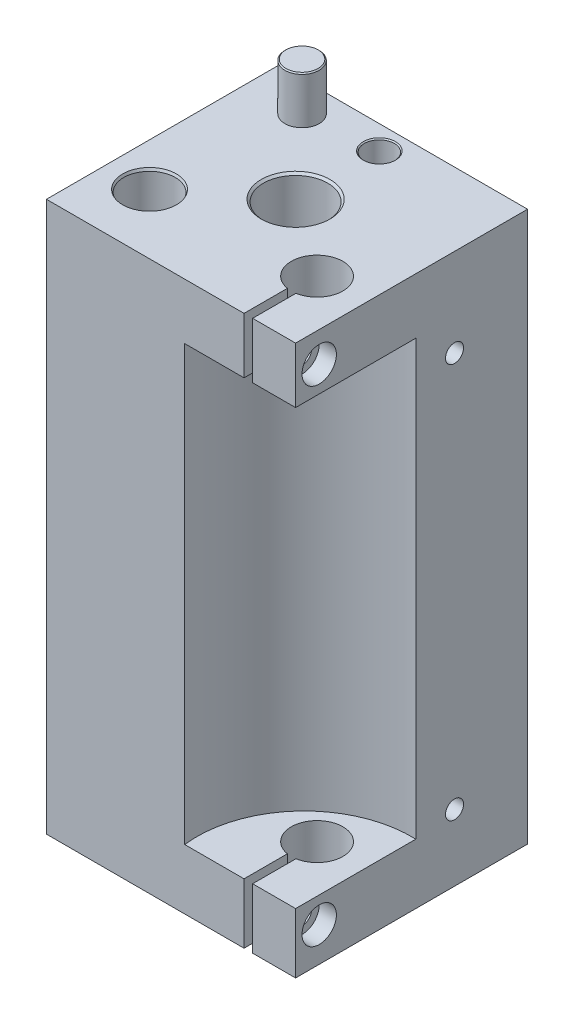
ISO-10303-21;
HEADER;
FILE_DESCRIPTION(('STEP AP214'),'2;1');
FILE_NAME('part.step','',(''),(''),'','','');
FILE_SCHEMA(('AUTOMOTIVE_DESIGN { 1 0 10303 214 1 1 1 1 }'));
ENDSEC;
DATA;
#1=APPLICATION_CONTEXT('core data for automotive mechanical design processes');
#2=APPLICATION_PROTOCOL_DEFINITION('international standard','automotive_design',2000,#1);
#3=PRODUCT_CONTEXT('',#1,'mechanical');
#4=PRODUCT('Part','Part','',(#3));
#5=PRODUCT_RELATED_PRODUCT_CATEGORY('part','',(#4));
#6=PRODUCT_DEFINITION_FORMATION('','',#4);
#7=PRODUCT_DEFINITION_CONTEXT('part definition',#1,'design');
#8=PRODUCT_DEFINITION('design','',#6,#7);
#9=PRODUCT_DEFINITION_SHAPE('','',#8);
#10=(LENGTH_UNIT() NAMED_UNIT(*) SI_UNIT(.MILLI.,.METRE.));
#11=(NAMED_UNIT(*) PLANE_ANGLE_UNIT() SI_UNIT($,.RADIAN.));
#12=(NAMED_UNIT(*) SI_UNIT($,.STERADIAN.) SOLID_ANGLE_UNIT());
#13=UNCERTAINTY_MEASURE_WITH_UNIT(LENGTH_MEASURE(1.E-05),#10,'distance_accuracy_value','');
#14=(GEOMETRIC_REPRESENTATION_CONTEXT(3) GLOBAL_UNCERTAINTY_ASSIGNED_CONTEXT((#13)) GLOBAL_UNIT_ASSIGNED_CONTEXT((#10,
#11,#12)) REPRESENTATION_CONTEXT('',''));
#15=CARTESIAN_POINT('',(0.,0.,0.));
#16=DIRECTION('',(0.,0.,1.));
#17=DIRECTION('',(1.,0.,0.));
#18=AXIS2_PLACEMENT_3D('',#15,#16,#17);
#19=CARTESIAN_POINT('',(58.,128.,0.));
#20=DIRECTION('',(-1.,0.,0.));
#21=DIRECTION('',(0.,0.,1.));
#22=AXIS2_PLACEMENT_3D('',#19,#20,#21);
#23=PLANE('',#22);
#24=CARTESIAN_POINT('',(58.,121.,-5.5));
#25=DIRECTION('',(1.,0.,0.));
#26=DIRECTION('',(0.,0.,-1.));
#27=AXIS2_PLACEMENT_3D('',#24,#25,#26);
#28=CIRCLE('',#27,4.);
#29=CARTESIAN_POINT('',(58.,121.,-9.5));
#30=VERTEX_POINT('',#29);
#31=EDGE_CURVE('E9355',#30,#30,#28,.T.);
#32=ORIENTED_EDGE('',*,*,#31,.F.);
#33=EDGE_LOOP('',(#32));
#34=FACE_BOUND('',#33,.T.);
#35=CARTESIAN_POINT('',(58.,15.5,-37.));
#36=DIRECTION('',(1.,0.,0.));
#37=DIRECTION('',(0.,0.,-1.));
#38=AXIS2_PLACEMENT_3D('',#35,#36,#37);
#39=CIRCLE('',#38,2.09999999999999);
#40=CARTESIAN_POINT('',(58.,15.5,-39.1));
#41=VERTEX_POINT('',#40);
#42=EDGE_CURVE('E9364',#41,#41,#39,.T.);
#43=ORIENTED_EDGE('',*,*,#42,.F.);
#44=EDGE_LOOP('',(#43));
#45=FACE_BOUND('',#44,.T.);
#46=CARTESIAN_POINT('',(58.,107.5,-37.));
#47=DIRECTION('',(1.,0.,0.));
#48=DIRECTION('',(0.,0.,-1.));
#49=AXIS2_PLACEMENT_3D('',#46,#47,#48);
#50=CIRCLE('',#49,2.1);
#51=CARTESIAN_POINT('',(58.,107.5,-39.1));
#52=VERTEX_POINT('',#51);
#53=EDGE_CURVE('E9370',#52,#52,#50,.T.);
#54=ORIENTED_EDGE('',*,*,#53,.F.);
#55=EDGE_LOOP('',(#54));
#56=FACE_BOUND('',#55,.T.);
#57=DIRECTION('',(0.,0.,1.));
#58=VECTOR('',#57,1.);
#59=CARTESIAN_POINT('',(58.,115.,0.));
#60=LINE('',#59,#58);
#61=CARTESIAN_POINT('',(58.,115.,-27.9799919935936));
#62=VERTEX_POINT('',#61);
#63=CARTESIAN_POINT('',(58.,115.,0.));
#64=VERTEX_POINT('',#63);
#65=EDGE_CURVE('E9452',#62,#64,#60,.T.);
#66=ORIENTED_EDGE('',*,*,#65,.F.);
#67=DIRECTION('',(0.,-1.,0.));
#68=VECTOR('',#67,1.);
#69=CARTESIAN_POINT('',(58.,115.,-27.9799919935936));
#70=LINE('',#69,#68);
#71=CARTESIAN_POINT('',(58.,14.,-27.9799919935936));
#72=VERTEX_POINT('',#71);
#73=EDGE_CURVE('E11',#62,#72,#70,.T.);
#74=ORIENTED_EDGE('',*,*,#73,.T.);
#75=DIRECTION('',(0.,0.,1.));
#76=VECTOR('',#75,1.);
#77=CARTESIAN_POINT('',(58.,14.,0.));
#78=LINE('',#77,#76);
#79=CARTESIAN_POINT('',(58.,14.,0.));
#80=VERTEX_POINT('',#79);
#81=EDGE_CURVE('E9440',#72,#80,#78,.T.);
#82=ORIENTED_EDGE('',*,*,#81,.T.);
#83=DIRECTION('',(0.,-1.,0.));
#84=VECTOR('',#83,1.);
#85=CARTESIAN_POINT('',(58.,128.,0.));
#86=LINE('',#85,#84);
#87=CARTESIAN_POINT('',(58.,0.,0.));
#88=VERTEX_POINT('',#87);
#89=EDGE_CURVE('E9547',#80,#88,#86,.T.);
#90=ORIENTED_EDGE('',*,*,#89,.T.);
#91=DIRECTION('',(0.,0.,-1.));
#92=VECTOR('',#91,1.);
#93=CARTESIAN_POINT('',(58.,0.,0.));
#94=LINE('',#93,#92);
#95=CARTESIAN_POINT('',(58.,0.,-54.));
#96=VERTEX_POINT('',#95);
#97=EDGE_CURVE('E9526',#88,#96,#94,.T.);
#98=ORIENTED_EDGE('',*,*,#97,.T.);
#99=DIRECTION('',(0.,-1.,0.));
#100=VECTOR('',#99,1.);
#101=CARTESIAN_POINT('',(58.,128.,-54.));
#102=LINE('',#101,#100);
#103=CARTESIAN_POINT('',(58.,128.,-54.));
#104=VERTEX_POINT('',#103);
#105=EDGE_CURVE('E9544',#104,#96,#102,.T.);
#106=ORIENTED_EDGE('',*,*,#105,.F.);
#107=DIRECTION('',(0.,0.,-1.));
#108=VECTOR('',#107,1.);
#109=CARTESIAN_POINT('',(58.,128.,0.));
#110=LINE('',#109,#108);
#111=CARTESIAN_POINT('',(58.,128.,0.));
#112=VERTEX_POINT('',#111);
#113=EDGE_CURVE('E9537',#112,#104,#110,.T.);
#114=ORIENTED_EDGE('',*,*,#113,.F.);
#115=EDGE_CURVE('E9548',#112,#64,#86,.T.);
#116=ORIENTED_EDGE('',*,*,#115,.T.);
#117=EDGE_LOOP('',(#66,#74,#82,#90,#98,#106,#114,#116));
#118=FACE_BOUND('',#117,.T.);
#119=CARTESIAN_POINT('',(58.,8.,-5.5));
#120=DIRECTION('',(1.,0.,0.));
#121=DIRECTION('',(0.,0.,-1.));
#122=AXIS2_PLACEMENT_3D('',#119,#120,#121);
#123=CIRCLE('',#122,3.99999999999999);
#124=CARTESIAN_POINT('',(58.,8.,-9.49999999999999));
#125=VERTEX_POINT('',#124);
#126=EDGE_CURVE('E9343',#125,#125,#123,.T.);
#127=ORIENTED_EDGE('',*,*,#126,.F.);
#128=EDGE_LOOP('',(#127));
#129=FACE_BOUND('',#128,.T.);
#130=ADVANCED_FACE('F9174',(#34,#45,#56,#118,#129),#23,.F.);
#131=CARTESIAN_POINT('',(0.,128.,0.));
#132=DIRECTION('',(0.,0.,-1.));
#133=DIRECTION('',(-1.,0.,0.));
#134=AXIS2_PLACEMENT_3D('',#131,#132,#133);
#135=PLANE('',#134);
#136=DIRECTION('',(-1.,0.,0.));
#137=VECTOR('',#136,1.);
#138=CARTESIAN_POINT('',(0.,115.,0.));
#139=LINE('',#138,#137);
#140=CARTESIAN_POINT('',(48.,115.,0.));
#141=VERTEX_POINT('',#140);
#142=EDGE_CURVE('E9448',#64,#141,#139,.T.);
#143=ORIENTED_EDGE('',*,*,#142,.F.);
#144=ORIENTED_EDGE('',*,*,#115,.F.);
#145=DIRECTION('',(1.,0.,0.));
#146=VECTOR('',#145,1.);
#147=CARTESIAN_POINT('',(0.,128.,0.));
#148=LINE('',#147,#146);
#149=CARTESIAN_POINT('',(48.,128.,0.));
#150=VERTEX_POINT('',#149);
#151=EDGE_CURVE('E9533',#150,#112,#148,.T.);
#152=ORIENTED_EDGE('',*,*,#151,.F.);
#153=DIRECTION('',(0.,1.,0.));
#154=VECTOR('',#153,1.);
#155=CARTESIAN_POINT('',(48.,130.,0.));
#156=LINE('',#155,#154);
#157=EDGE_CURVE('E9459',#141,#150,#156,.T.);
#158=ORIENTED_EDGE('',*,*,#157,.F.);
#159=EDGE_LOOP('',(#143,#144,#152,#158));
#160=FACE_BOUND('',#159,.T.);
#161=ADVANCED_FACE('F9602',(#160),#135,.F.);
#162=DIRECTION('',(-1.,0.,0.));
#163=VECTOR('',#162,1.);
#164=CARTESIAN_POINT('',(0.,115.,0.));
#165=LINE('',#164,#163);
#166=CARTESIAN_POINT('',(46.,115.,0.));
#167=VERTEX_POINT('',#166);
#168=CARTESIAN_POINT('',(32.1806527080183,115.,0.));
#169=VERTEX_POINT('',#168);
#170=EDGE_CURVE('E9454',#167,#169,#165,.T.);
#171=ORIENTED_EDGE('',*,*,#170,.F.);
#172=DIRECTION('',(0.,-1.,0.));
#173=VECTOR('',#172,1.);
#174=CARTESIAN_POINT('',(46.,130.,0.));
#175=LINE('',#174,#173);
#176=CARTESIAN_POINT('',(46.,128.,0.));
#177=VERTEX_POINT('',#176);
#178=EDGE_CURVE('E9464',#177,#167,#175,.T.);
#179=ORIENTED_EDGE('',*,*,#178,.F.);
#180=CARTESIAN_POINT('',(0.,128.,0.));
#181=VERTEX_POINT('',#180);
#182=EDGE_CURVE('E9534',#181,#177,#148,.T.);
#183=ORIENTED_EDGE('',*,*,#182,.F.);
#184=DIRECTION('',(0.,-1.,0.));
#185=VECTOR('',#184,1.);
#186=CARTESIAN_POINT('',(0.,128.,0.));
#187=LINE('',#186,#185);
#188=CARTESIAN_POINT('',(0.,0.,0.));
#189=VERTEX_POINT('',#188);
#190=EDGE_CURVE('E9551',#181,#189,#187,.T.);
#191=ORIENTED_EDGE('',*,*,#190,.T.);
#192=DIRECTION('',(1.,0.,0.));
#193=VECTOR('',#192,1.);
#194=CARTESIAN_POINT('',(0.,0.,0.));
#195=LINE('',#194,#193);
#196=CARTESIAN_POINT('',(46.,0.,0.));
#197=VERTEX_POINT('',#196);
#198=EDGE_CURVE('E9523',#189,#197,#195,.T.);
#199=ORIENTED_EDGE('',*,*,#198,.T.);
#200=CARTESIAN_POINT('',(46.,14.,0.));
#201=VERTEX_POINT('',#200);
#202=EDGE_CURVE('E9463',#201,#197,#175,.T.);
#203=ORIENTED_EDGE('',*,*,#202,.F.);
#204=DIRECTION('',(-1.,0.,0.));
#205=VECTOR('',#204,1.);
#206=CARTESIAN_POINT('',(0.,14.,0.));
#207=LINE('',#206,#205);
#208=CARTESIAN_POINT('',(32.1806527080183,14.,0.));
#209=VERTEX_POINT('',#208);
#210=EDGE_CURVE('E9443',#201,#209,#207,.T.);
#211=ORIENTED_EDGE('',*,*,#210,.T.);
#212=DIRECTION('',(0.,-1.,0.));
#213=VECTOR('',#212,1.);
#214=CARTESIAN_POINT('',(32.1806527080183,115.,0.));
#215=LINE('',#214,#213);
#216=EDGE_CURVE('E9456',#209,#169,#215,.F.);
#217=ORIENTED_EDGE('',*,*,#216,.T.);
#218=EDGE_LOOP('',(#171,#179,#183,#191,#199,#203,#211,#217));
#219=FACE_BOUND('',#218,.T.);
#220=ADVANCED_FACE('F9590',(#219),#135,.F.);
#221=CARTESIAN_POINT('',(47.,128.,-16.));
#222=DIRECTION('',(0.,1.,0.));
#223=DIRECTION('',(0.,0.,1.));
#224=AXIS2_PLACEMENT_3D('',#221,#222,#223);
#225=CYLINDRICAL_SURFACE('',#224,5.99999999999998);
#226=CARTESIAN_POINT('',(47.,115.,-16.));
#227=DIRECTION('',(0.,-1.,0.));
#228=DIRECTION('',(0.,0.,-1.));
#229=AXIS2_PLACEMENT_3D('',#226,#227,#228);
#230=CIRCLE('',#229,5.99999999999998);
#231=CARTESIAN_POINT('',(48.,115.,-10.0839202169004));
#232=VERTEX_POINT('',#231);
#233=CARTESIAN_POINT('',(46.,115.,-10.0839202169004));
#234=VERTEX_POINT('',#233);
#235=EDGE_CURVE('E9446',#232,#234,#230,.F.);
#236=ORIENTED_EDGE('',*,*,#235,.F.);
#237=DIRECTION('',(0.,1.,0.));
#238=VECTOR('',#237,1.);
#239=CARTESIAN_POINT('',(48.,128.,-10.0839202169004));
#240=LINE('',#239,#238);
#241=CARTESIAN_POINT('',(48.,128.,-10.0839202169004));
#242=VERTEX_POINT('',#241);
#243=EDGE_CURVE('E9197',#232,#242,#240,.T.);
#244=ORIENTED_EDGE('',*,*,#243,.T.);
#245=CARTESIAN_POINT('',(47.,128.,-16.));
#246=DIRECTION('',(0.,1.,0.));
#247=DIRECTION('',(0.,0.,1.));
#248=AXIS2_PLACEMENT_3D('',#245,#246,#247);
#249=CIRCLE('',#248,5.99999999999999);
#250=CARTESIAN_POINT('',(46.,128.,-10.0839202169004));
#251=VERTEX_POINT('',#250);
#252=EDGE_CURVE('E9481',#242,#251,#249,.T.);
#253=ORIENTED_EDGE('',*,*,#252,.T.);
#254=DIRECTION('',(0.,1.,0.));
#255=VECTOR('',#254,1.);
#256=CARTESIAN_POINT('',(46.,128.,-10.0839202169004));
#257=LINE('',#256,#255);
#258=EDGE_CURVE('E9564',#251,#234,#257,.F.);
#259=ORIENTED_EDGE('',*,*,#258,.T.);
#260=EDGE_LOOP('',(#236,#244,#253,#259));
#261=FACE_BOUND('',#260,.T.);
#262=ADVANCED_FACE('F9578',(#261),#225,.F.);
#263=CARTESIAN_POINT('',(46.,130.,-16.));
#264=DIRECTION('',(-1.,0.,0.));
#265=DIRECTION('',(0.,-1.,0.));
#266=AXIS2_PLACEMENT_3D('',#263,#264,#265);
#267=PLANE('',#266);
#268=CARTESIAN_POINT('',(46.,121.,-5.5));
#269=DIRECTION('',(1.,0.,0.));
#270=DIRECTION('',(0.,0.,-1.));
#271=AXIS2_PLACEMENT_3D('',#268,#269,#270);
#272=CIRCLE('',#271,1.64999999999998);
#273=CARTESIAN_POINT('',(46.,121.,-7.14999999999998));
#274=VERTEX_POINT('',#273);
#275=EDGE_CURVE('E9329',#274,#274,#272,.T.);
#276=ORIENTED_EDGE('',*,*,#275,.F.);
#277=EDGE_LOOP('',(#276));
#278=FACE_BOUND('',#277,.T.);
#279=DIRECTION('',(0.,0.,1.));
#280=VECTOR('',#279,1.);
#281=CARTESIAN_POINT('',(46.,115.,-16.));
#282=LINE('',#281,#280);
#283=EDGE_CURVE('E9450',#234,#167,#282,.T.);
#284=ORIENTED_EDGE('',*,*,#283,.F.);
#285=ORIENTED_EDGE('',*,*,#258,.F.);
#286=DIRECTION('',(0.,0.,-1.));
#287=VECTOR('',#286,1.);
#288=CARTESIAN_POINT('',(46.,128.,-54.));
#289=LINE('',#288,#287);
#290=EDGE_CURVE('E9467',#177,#251,#289,.T.);
#291=ORIENTED_EDGE('',*,*,#290,.F.);
#292=ORIENTED_EDGE('',*,*,#178,.T.);
#293=EDGE_LOOP('',(#284,#285,#291,#292));
#294=FACE_BOUND('',#293,.T.);
#295=ADVANCED_FACE('F9587',(#278,#294),#267,.F.);
#296=CARTESIAN_POINT('',(48.,130.,-16.));
#297=DIRECTION('',(1.,0.,0.));
#298=DIRECTION('',(0.,1.,0.));
#299=AXIS2_PLACEMENT_3D('',#296,#297,#298);
#300=PLANE('',#299);
#301=CARTESIAN_POINT('',(48.,121.,-5.5));
#302=DIRECTION('',(1.,0.,0.));
#303=DIRECTION('',(0.,1.,0.));
#304=AXIS2_PLACEMENT_3D('',#301,#302,#303);
#305=CIRCLE('',#304,2.25);
#306=CARTESIAN_POINT('',(48.,123.25,-5.5));
#307=VERTEX_POINT('',#306);
#308=EDGE_CURVE('E9358',#307,#307,#305,.T.);
#309=ORIENTED_EDGE('',*,*,#308,.T.);
#310=EDGE_LOOP('',(#309));
#311=FACE_BOUND('',#310,.T.);
#312=DIRECTION('',(0.,0.,-1.));
#313=VECTOR('',#312,1.);
#314=CARTESIAN_POINT('',(48.,115.,-16.));
#315=LINE('',#314,#313);
#316=EDGE_CURVE('E9182',#141,#232,#315,.T.);
#317=ORIENTED_EDGE('',*,*,#316,.F.);
#318=ORIENTED_EDGE('',*,*,#157,.T.);
#319=DIRECTION('',(0.,0.,1.));
#320=VECTOR('',#319,1.);
#321=CARTESIAN_POINT('',(48.,128.,-54.));
#322=LINE('',#321,#320);
#323=EDGE_CURVE('E9473',#242,#150,#322,.T.);
#324=ORIENTED_EDGE('',*,*,#323,.F.);
#325=ORIENTED_EDGE('',*,*,#243,.F.);
#326=EDGE_LOOP('',(#317,#318,#324,#325));
#327=FACE_BOUND('',#326,.T.);
#328=ADVANCED_FACE('F9579',(#311,#327),#300,.F.);
#329=ORIENTED_EDGE('',*,*,#89,.F.);
#330=DIRECTION('',(-1.,0.,0.));
#331=VECTOR('',#330,1.);
#332=CARTESIAN_POINT('',(0.,14.,0.));
#333=LINE('',#332,#331);
#334=CARTESIAN_POINT('',(48.,14.,0.));
#335=VERTEX_POINT('',#334);
#336=EDGE_CURVE('E9434',#80,#335,#333,.T.);
#337=ORIENTED_EDGE('',*,*,#336,.T.);
#338=CARTESIAN_POINT('',(48.,0.,0.));
#339=VERTEX_POINT('',#338);
#340=EDGE_CURVE('E9460',#339,#335,#156,.T.);
#341=ORIENTED_EDGE('',*,*,#340,.F.);
#342=EDGE_CURVE('E9522',#339,#88,#195,.T.);
#343=ORIENTED_EDGE('',*,*,#342,.T.);
#344=EDGE_LOOP('',(#329,#337,#341,#343));
#345=FACE_BOUND('',#344,.T.);
#346=ADVANCED_FACE('F9633',(#345),#135,.F.);
#347=CARTESIAN_POINT('',(0.,0.,-54.));
#348=DIRECTION('',(0.,-1.,0.));
#349=DIRECTION('',(0.,0.,-1.));
#350=AXIS2_PLACEMENT_3D('',#347,#348,#349);
#351=PLANE('',#350);
#352=DIRECTION('',(0.,0.,1.));
#353=VECTOR('',#352,1.);
#354=CARTESIAN_POINT('',(48.,0.,-54.));
#355=LINE('',#354,#353);
#356=CARTESIAN_POINT('',(48.,0.,-10.0839202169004));
#357=VERTEX_POINT('',#356);
#358=EDGE_CURVE('E9476',#357,#339,#355,.T.);
#359=ORIENTED_EDGE('',*,*,#358,.F.);
#360=CARTESIAN_POINT('',(47.,0.,-16.));
#361=DIRECTION('',(0.,1.,0.));
#362=DIRECTION('',(0.,0.,1.));
#363=AXIS2_PLACEMENT_3D('',#360,#361,#362);
#364=CIRCLE('',#363,5.99999999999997);
#365=CARTESIAN_POINT('',(46.,0.,-10.0839202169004));
#366=VERTEX_POINT('',#365);
#367=EDGE_CURVE('E9478',#357,#366,#364,.T.);
#368=ORIENTED_EDGE('',*,*,#367,.T.);
#369=DIRECTION('',(0.,0.,-1.));
#370=VECTOR('',#369,1.);
#371=CARTESIAN_POINT('',(46.,0.,-54.));
#372=LINE('',#371,#370);
#373=EDGE_CURVE('E9470',#197,#366,#372,.T.);
#374=ORIENTED_EDGE('',*,*,#373,.F.);
#375=ORIENTED_EDGE('',*,*,#198,.F.);
#376=DIRECTION('',(0.,0.,1.));
#377=VECTOR('',#376,1.);
#378=CARTESIAN_POINT('',(0.,0.,0.));
#379=LINE('',#378,#377);
#380=CARTESIAN_POINT('',(0.,0.,-54.));
#381=VERTEX_POINT('',#380);
#382=EDGE_CURVE('E9519',#381,#189,#379,.T.);
#383=ORIENTED_EDGE('',*,*,#382,.F.);
#384=DIRECTION('',(-1.,0.,0.));
#385=VECTOR('',#384,1.);
#386=CARTESIAN_POINT('',(0.,0.,-54.));
#387=LINE('',#386,#385);
#388=EDGE_CURVE('E9528',#96,#381,#387,.T.);
#389=ORIENTED_EDGE('',*,*,#388,.F.);
#390=ORIENTED_EDGE('',*,*,#97,.F.);
#391=ORIENTED_EDGE('',*,*,#342,.F.);
#392=EDGE_LOOP('',(#359,#368,#374,#375,#383,#389,#390,#391));
#393=FACE_BOUND('',#392,.T.);
#394=CARTESIAN_POINT('',(29.,0.,-48.5));
#395=DIRECTION('',(0.,1.,0.));
#396=DIRECTION('',(0.,0.,1.));
#397=AXIS2_PLACEMENT_3D('',#394,#395,#396);
#398=CIRCLE('',#397,3.74999999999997);
#399=CARTESIAN_POINT('',(29.,0.,-44.75));
#400=VERTEX_POINT('',#399);
#401=EDGE_CURVE('E9483',#400,#400,#398,.T.);
#402=ORIENTED_EDGE('',*,*,#401,.T.);
#403=EDGE_LOOP('',(#402));
#404=FACE_BOUND('',#403,.T.);
#405=CARTESIAN_POINT('',(29.,0.,-29.));
#406=DIRECTION('',(0.,1.,0.));
#407=DIRECTION('',(0.,0.,1.));
#408=AXIS2_PLACEMENT_3D('',#405,#406,#407);
#409=CIRCLE('',#408,7.99999999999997);
#410=CARTESIAN_POINT('',(29.,0.,-21.));
#411=VERTEX_POINT('',#410);
#412=EDGE_CURVE('E9507',#411,#411,#409,.T.);
#413=ORIENTED_EDGE('',*,*,#412,.T.);
#414=EDGE_LOOP('',(#413));
#415=FACE_BOUND('',#414,.T.);
#416=CARTESIAN_POINT('',(10.,0.,-14.));
#417=DIRECTION('',(0.,1.,0.));
#418=DIRECTION('',(0.,0.,1.));
#419=AXIS2_PLACEMENT_3D('',#416,#417,#418);
#420=CIRCLE('',#419,6.24999999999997);
#421=CARTESIAN_POINT('',(10.,0.,-7.75000000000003));
#422=VERTEX_POINT('',#421);
#423=EDGE_CURVE('E9495',#422,#422,#420,.T.);
#424=ORIENTED_EDGE('',*,*,#423,.T.);
#425=EDGE_LOOP('',(#424));
#426=FACE_BOUND('',#425,.T.);
#427=ADVANCED_FACE('F9618',(#393,#404,#415,#426),#351,.T.);
#428=CARTESIAN_POINT('',(0.,128.,-54.));
#429=DIRECTION('',(0.,-1.,0.));
#430=DIRECTION('',(0.,0.,-1.));
#431=AXIS2_PLACEMENT_3D('',#428,#429,#430);
#432=PLANE('',#431);
#433=ORIENTED_EDGE('',*,*,#252,.F.);
#434=ORIENTED_EDGE('',*,*,#323,.T.);
#435=ORIENTED_EDGE('',*,*,#151,.T.);
#436=ORIENTED_EDGE('',*,*,#113,.T.);
#437=DIRECTION('',(-1.,0.,0.));
#438=VECTOR('',#437,1.);
#439=CARTESIAN_POINT('',(0.,128.,-54.));
#440=LINE('',#439,#438);
#441=CARTESIAN_POINT('',(0.,128.,-54.));
#442=VERTEX_POINT('',#441);
#443=EDGE_CURVE('E9539',#104,#442,#440,.T.);
#444=ORIENTED_EDGE('',*,*,#443,.T.);
#445=DIRECTION('',(0.,0.,1.));
#446=VECTOR('',#445,1.);
#447=CARTESIAN_POINT('',(0.,128.,0.));
#448=LINE('',#447,#446);
#449=EDGE_CURVE('E9530',#442,#181,#448,.T.);
#450=ORIENTED_EDGE('',*,*,#449,.T.);
#451=ORIENTED_EDGE('',*,*,#182,.T.);
#452=ORIENTED_EDGE('',*,*,#290,.T.);
#453=EDGE_LOOP('',(#433,#434,#435,#436,#444,#450,#451,#452));
#454=FACE_BOUND('',#453,.T.);
#455=CARTESIAN_POINT('',(29.,128.,-29.));
#456=DIRECTION('',(0.,1.,0.));
#457=DIRECTION('',(0.,0.,1.));
#458=AXIS2_PLACEMENT_3D('',#455,#456,#457);
#459=CIRCLE('',#458,8.);
#460=CARTESIAN_POINT('',(29.,128.,-21.));
#461=VERTEX_POINT('',#460);
#462=EDGE_CURVE('E9516',#461,#461,#459,.T.);
#463=ORIENTED_EDGE('',*,*,#462,.F.);
#464=EDGE_LOOP('',(#463));
#465=FACE_BOUND('',#464,.T.);
#466=CARTESIAN_POINT('',(10.,128.,-14.));
#467=DIRECTION('',(0.,1.,0.));
#468=DIRECTION('',(0.,0.,1.));
#469=AXIS2_PLACEMENT_3D('',#466,#467,#468);
#470=CIRCLE('',#469,6.25);
#471=CARTESIAN_POINT('',(10.,128.,-7.75));
#472=VERTEX_POINT('',#471);
#473=EDGE_CURVE('E9504',#472,#472,#470,.T.);
#474=ORIENTED_EDGE('',*,*,#473,.F.);
#475=EDGE_LOOP('',(#474));
#476=FACE_BOUND('',#475,.T.);
#477=CARTESIAN_POINT('',(29.,128.,-48.5));
#478=DIRECTION('',(0.,1.,0.));
#479=DIRECTION('',(0.,0.,1.));
#480=AXIS2_PLACEMENT_3D('',#477,#478,#479);
#481=CIRCLE('',#480,3.75);
#482=CARTESIAN_POINT('',(29.,128.,-44.75));
#483=VERTEX_POINT('',#482);
#484=EDGE_CURVE('E9492',#483,#483,#481,.T.);
#485=ORIENTED_EDGE('',*,*,#484,.F.);
#486=EDGE_LOOP('',(#485));
#487=FACE_BOUND('',#486,.T.);
#488=CARTESIAN_POINT('',(12.5,128.,-47.));
#489=DIRECTION('',(0.,-1.,0.));
#490=DIRECTION('',(0.,0.,-1.));
#491=AXIS2_PLACEMENT_3D('',#488,#489,#490);
#492=CIRCLE('',#491,4.);
#493=CARTESIAN_POINT('',(12.5,128.,-51.));
#494=VERTEX_POINT('',#493);
#495=EDGE_CURVE('E9554',#494,#494,#492,.F.);
#496=ORIENTED_EDGE('',*,*,#495,.F.);
#497=EDGE_LOOP('',(#496));
#498=FACE_BOUND('',#497,.T.);
#499=ADVANCED_FACE('F9583',(#454,#465,#476,#487,#498),#432,.F.);
#500=CARTESIAN_POINT('',(0.,128.,0.));
#501=DIRECTION('',(1.,0.,0.));
#502=DIRECTION('',(0.,0.,-1.));
#503=AXIS2_PLACEMENT_3D('',#500,#501,#502);
#504=PLANE('',#503);
#505=CARTESIAN_POINT('',(0.,15.5,-37.));
#506=DIRECTION('',(-1.,0.,0.));
#507=DIRECTION('',(0.,0.,1.));
#508=AXIS2_PLACEMENT_3D('',#505,#506,#507);
#509=CIRCLE('',#508,2.09999999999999);
#510=CARTESIAN_POINT('',(0.,15.5,-34.9));
#511=VERTEX_POINT('',#510);
#512=EDGE_CURVE('E9418',#511,#511,#509,.T.);
#513=ORIENTED_EDGE('',*,*,#512,.F.);
#514=EDGE_LOOP('',(#513));
#515=FACE_BOUND('',#514,.T.);
#516=CARTESIAN_POINT('',(0.,107.5,-37.));
#517=DIRECTION('',(-1.,0.,0.));
#518=DIRECTION('',(0.,0.,1.));
#519=AXIS2_PLACEMENT_3D('',#516,#517,#518);
#520=CIRCLE('',#519,2.09999999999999);
#521=CARTESIAN_POINT('',(0.,107.5,-34.9));
#522=VERTEX_POINT('',#521);
#523=EDGE_CURVE('E9424',#522,#522,#520,.T.);
#524=ORIENTED_EDGE('',*,*,#523,.F.);
#525=EDGE_LOOP('',(#524));
#526=FACE_BOUND('',#525,.T.);
#527=ORIENTED_EDGE('',*,*,#382,.T.);
#528=ORIENTED_EDGE('',*,*,#190,.F.);
#529=ORIENTED_EDGE('',*,*,#449,.F.);
#530=DIRECTION('',(0.,-1.,0.));
#531=VECTOR('',#530,1.);
#532=CARTESIAN_POINT('',(0.,128.,-54.));
#533=LINE('',#532,#531);
#534=EDGE_CURVE('E9541',#442,#381,#533,.T.);
#535=ORIENTED_EDGE('',*,*,#534,.T.);
#536=EDGE_LOOP('',(#527,#528,#529,#535));
#537=FACE_BOUND('',#536,.T.);
#538=ADVANCED_FACE('F9176',(#515,#526,#537),#504,.F.);
#539=CARTESIAN_POINT('',(0.,128.,-54.));
#540=DIRECTION('',(0.,0.,1.));
#541=DIRECTION('',(1.,0.,0.));
#542=AXIS2_PLACEMENT_3D('',#539,#540,#541);
#543=PLANE('',#542);
#544=CARTESIAN_POINT('',(52.,106.,-54.));
#545=DIRECTION('',(0.,0.,-1.));
#546=DIRECTION('',(-1.,0.,0.));
#547=AXIS2_PLACEMENT_3D('',#544,#545,#546);
#548=CIRCLE('',#547,2.625);
#549=CARTESIAN_POINT('',(49.375,106.,-54.));
#550=VERTEX_POINT('',#549);
#551=EDGE_CURVE('E9379',#550,#550,#548,.T.);
#552=ORIENTED_EDGE('',*,*,#551,.F.);
#553=EDGE_LOOP('',(#552));
#554=FACE_BOUND('',#553,.T.);
#555=CARTESIAN_POINT('',(6.,106.,-54.));
#556=DIRECTION('',(0.,0.,-1.));
#557=DIRECTION('',(-1.,0.,0.));
#558=AXIS2_PLACEMENT_3D('',#555,#556,#557);
#559=CIRCLE('',#558,2.625);
#560=CARTESIAN_POINT('',(3.375,106.,-54.));
#561=VERTEX_POINT('',#560);
#562=EDGE_CURVE('E9388',#561,#561,#559,.T.);
#563=ORIENTED_EDGE('',*,*,#562,.F.);
#564=EDGE_LOOP('',(#563));
#565=FACE_BOUND('',#564,.T.);
#566=CARTESIAN_POINT('',(52.,91.,-54.));
#567=DIRECTION('',(0.,0.,-1.));
#568=DIRECTION('',(-1.,0.,0.));
#569=AXIS2_PLACEMENT_3D('',#566,#567,#568);
#570=CIRCLE('',#569,2.5);
#571=CARTESIAN_POINT('',(49.5,91.,-54.));
#572=VERTEX_POINT('',#571);
#573=EDGE_CURVE('E9394',#572,#572,#570,.T.);
#574=ORIENTED_EDGE('',*,*,#573,.F.);
#575=EDGE_LOOP('',(#574));
#576=FACE_BOUND('',#575,.T.);
#577=CARTESIAN_POINT('',(52.,121.,-54.));
#578=DIRECTION('',(0.,0.,-1.));
#579=DIRECTION('',(-1.,0.,0.));
#580=AXIS2_PLACEMENT_3D('',#577,#578,#579);
#581=CIRCLE('',#580,2.5);
#582=CARTESIAN_POINT('',(49.5,121.,-54.));
#583=VERTEX_POINT('',#582);
#584=EDGE_CURVE('E9400',#583,#583,#581,.T.);
#585=ORIENTED_EDGE('',*,*,#584,.F.);
#586=EDGE_LOOP('',(#585));
#587=FACE_BOUND('',#586,.T.);
#588=CARTESIAN_POINT('',(6.,91.,-54.));
#589=DIRECTION('',(0.,0.,-1.));
#590=DIRECTION('',(-1.,0.,0.));
#591=AXIS2_PLACEMENT_3D('',#588,#589,#590);
#592=CIRCLE('',#591,2.5);
#593=CARTESIAN_POINT('',(3.5,91.,-54.));
#594=VERTEX_POINT('',#593);
#595=EDGE_CURVE('E9406',#594,#594,#592,.T.);
#596=ORIENTED_EDGE('',*,*,#595,.F.);
#597=EDGE_LOOP('',(#596));
#598=FACE_BOUND('',#597,.T.);
#599=CARTESIAN_POINT('',(6.,121.,-54.));
#600=DIRECTION('',(0.,0.,-1.));
#601=DIRECTION('',(-1.,0.,0.));
#602=AXIS2_PLACEMENT_3D('',#599,#600,#601);
#603=CIRCLE('',#602,2.5);
#604=CARTESIAN_POINT('',(3.5,121.,-54.));
#605=VERTEX_POINT('',#604);
#606=EDGE_CURVE('E9412',#605,#605,#603,.T.);
#607=ORIENTED_EDGE('',*,*,#606,.F.);
#608=EDGE_LOOP('',(#607));
#609=FACE_BOUND('',#608,.T.);
#610=ORIENTED_EDGE('',*,*,#388,.T.);
#611=ORIENTED_EDGE('',*,*,#534,.F.);
#612=ORIENTED_EDGE('',*,*,#443,.F.);
#613=ORIENTED_EDGE('',*,*,#105,.T.);
#614=EDGE_LOOP('',(#610,#611,#612,#613));
#615=FACE_BOUND('',#614,.T.);
#616=ADVANCED_FACE('F9609',(#554,#565,#576,#587,#598,#609,#615),#543,.F.);
#617=CARTESIAN_POINT('',(29.,128.,-29.));
#618=DIRECTION('',(0.,1.,0.));
#619=DIRECTION('',(0.,0.,1.));
#620=AXIS2_PLACEMENT_3D('',#617,#618,#619);
#621=CONICAL_SURFACE('',#620,8.,0.785398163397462);
#622=CARTESIAN_POINT('',(29.,127.5,-29.));
#623=DIRECTION('',(0.,1.,0.));
#624=DIRECTION('',(0.,0.,1.));
#625=AXIS2_PLACEMENT_3D('',#622,#623,#624);
#626=CIRCLE('',#625,7.49999999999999);
#627=CARTESIAN_POINT('',(29.,127.5,-21.5));
#628=VERTEX_POINT('',#627);
#629=EDGE_CURVE('E9513',#628,#628,#626,.T.);
#630=ORIENTED_EDGE('',*,*,#629,.F.);
#631=EDGE_LOOP('',(#630));
#632=FACE_BOUND('',#631,.T.);
#633=ORIENTED_EDGE('',*,*,#462,.T.);
#634=EDGE_LOOP('',(#633));
#635=FACE_BOUND('',#634,.T.);
#636=ADVANCED_FACE('F9658',(#632,#635),#621,.F.);
#637=CARTESIAN_POINT('',(29.,128.,-29.));
#638=DIRECTION('',(0.,1.,0.));
#639=DIRECTION('',(0.,0.,1.));
#640=AXIS2_PLACEMENT_3D('',#637,#638,#639);
#641=CYLINDRICAL_SURFACE('',#640,7.49999999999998);
#642=CARTESIAN_POINT('',(29.,0.5,-29.));
#643=DIRECTION('',(0.,1.,0.));
#644=DIRECTION('',(0.,0.,1.));
#645=AXIS2_PLACEMENT_3D('',#642,#643,#644);
#646=CIRCLE('',#645,7.49999999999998);
#647=CARTESIAN_POINT('',(29.,0.5,-21.5));
#648=VERTEX_POINT('',#647);
#649=EDGE_CURVE('E9510',#648,#648,#646,.T.);
#650=ORIENTED_EDGE('',*,*,#649,.F.);
#651=EDGE_LOOP('',(#650));
#652=FACE_BOUND('',#651,.T.);
#653=ORIENTED_EDGE('',*,*,#629,.T.);
#654=EDGE_LOOP('',(#653));
#655=FACE_BOUND('',#654,.T.);
#656=ADVANCED_FACE('F9664',(#652,#655),#641,.F.);
#657=CARTESIAN_POINT('',(29.,0.5,-29.));
#658=DIRECTION('',(0.,-1.,0.));
#659=DIRECTION('',(0.,0.,-1.));
#660=AXIS2_PLACEMENT_3D('',#657,#658,#659);
#661=CONICAL_SURFACE('',#660,7.49999999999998,0.785398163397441);
#662=ORIENTED_EDGE('',*,*,#412,.F.);
#663=EDGE_LOOP('',(#662));
#664=FACE_BOUND('',#663,.T.);
#665=ORIENTED_EDGE('',*,*,#649,.T.);
#666=EDGE_LOOP('',(#665));
#667=FACE_BOUND('',#666,.T.);
#668=ADVANCED_FACE('F9668',(#664,#667),#661,.F.);
#669=CARTESIAN_POINT('',(10.,128.,-14.));
#670=DIRECTION('',(0.,1.,0.));
#671=DIRECTION('',(0.,0.,1.));
#672=AXIS2_PLACEMENT_3D('',#669,#670,#671);
#673=CONICAL_SURFACE('',#672,6.25,0.39269908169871);
#674=CARTESIAN_POINT('',(10.,127.396446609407,-14.));
#675=DIRECTION('',(0.,1.,0.));
#676=DIRECTION('',(0.,0.,1.));
#677=AXIS2_PLACEMENT_3D('',#674,#675,#676);
#678=CIRCLE('',#677,5.99999999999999);
#679=CARTESIAN_POINT('',(10.,127.396446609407,-8.00000000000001));
#680=VERTEX_POINT('',#679);
#681=EDGE_CURVE('E9501',#680,#680,#678,.T.);
#682=ORIENTED_EDGE('',*,*,#681,.F.);
#683=EDGE_LOOP('',(#682));
#684=FACE_BOUND('',#683,.T.);
#685=ORIENTED_EDGE('',*,*,#473,.T.);
#686=EDGE_LOOP('',(#685));
#687=FACE_BOUND('',#686,.T.);
#688=ADVANCED_FACE('F9672',(#684,#687),#673,.F.);
#689=CARTESIAN_POINT('',(10.,128.,-14.));
#690=DIRECTION('',(0.,1.,0.));
#691=DIRECTION('',(0.,0.,1.));
#692=AXIS2_PLACEMENT_3D('',#689,#690,#691);
#693=CYLINDRICAL_SURFACE('',#692,5.99999999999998);
#694=CARTESIAN_POINT('',(10.,0.603553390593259,-14.));
#695=DIRECTION('',(0.,1.,0.));
#696=DIRECTION('',(0.,0.,1.));
#697=AXIS2_PLACEMENT_3D('',#694,#695,#696);
#698=CIRCLE('',#697,5.99999999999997);
#699=CARTESIAN_POINT('',(10.,0.603553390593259,-8.00000000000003));
#700=VERTEX_POINT('',#699);
#701=EDGE_CURVE('E9498',#700,#700,#698,.T.);
#702=ORIENTED_EDGE('',*,*,#701,.F.);
#703=EDGE_LOOP('',(#702));
#704=FACE_BOUND('',#703,.T.);
#705=ORIENTED_EDGE('',*,*,#681,.T.);
#706=EDGE_LOOP('',(#705));
#707=FACE_BOUND('',#706,.T.);
#708=ADVANCED_FACE('F9676',(#704,#707),#693,.F.);
#709=CARTESIAN_POINT('',(10.,0.603553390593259,-14.));
#710=DIRECTION('',(0.,-1.,0.));
#711=DIRECTION('',(0.,0.,-1.));
#712=AXIS2_PLACEMENT_3D('',#709,#710,#711);
#713=CONICAL_SURFACE('',#712,5.99999999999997,0.392699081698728);
#714=ORIENTED_EDGE('',*,*,#423,.F.);
#715=EDGE_LOOP('',(#714));
#716=FACE_BOUND('',#715,.T.);
#717=ORIENTED_EDGE('',*,*,#701,.T.);
#718=EDGE_LOOP('',(#717));
#719=FACE_BOUND('',#718,.T.);
#720=ADVANCED_FACE('F9680',(#716,#719),#713,.F.);
#721=CARTESIAN_POINT('',(29.,128.,-48.5));
#722=DIRECTION('',(0.,1.,0.));
#723=DIRECTION('',(0.,0.,1.));
#724=AXIS2_PLACEMENT_3D('',#721,#722,#723);
#725=CONICAL_SURFACE('',#724,3.75,0.785398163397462);
#726=CARTESIAN_POINT('',(29.,127.75,-48.5));
#727=DIRECTION('',(0.,1.,0.));
#728=DIRECTION('',(0.,0.,1.));
#729=AXIS2_PLACEMENT_3D('',#726,#727,#728);
#730=CIRCLE('',#729,3.49999999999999);
#731=CARTESIAN_POINT('',(29.,127.75,-45.));
#732=VERTEX_POINT('',#731);
#733=EDGE_CURVE('E9489',#732,#732,#730,.T.);
#734=ORIENTED_EDGE('',*,*,#733,.F.);
#735=EDGE_LOOP('',(#734));
#736=FACE_BOUND('',#735,.T.);
#737=ORIENTED_EDGE('',*,*,#484,.T.);
#738=EDGE_LOOP('',(#737));
#739=FACE_BOUND('',#738,.T.);
#740=ADVANCED_FACE('F9684',(#736,#739),#725,.F.);
#741=CARTESIAN_POINT('',(29.,128.,-48.5));
#742=DIRECTION('',(0.,1.,0.));
#743=DIRECTION('',(0.,0.,1.));
#744=AXIS2_PLACEMENT_3D('',#741,#742,#743);
#745=CYLINDRICAL_SURFACE('',#744,3.49999999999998);
#746=CARTESIAN_POINT('',(29.,0.25,-48.5));
#747=DIRECTION('',(0.,1.,0.));
#748=DIRECTION('',(0.,0.,1.));
#749=AXIS2_PLACEMENT_3D('',#746,#747,#748);
#750=CIRCLE('',#749,3.49999999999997);
#751=CARTESIAN_POINT('',(29.,0.25,-45.));
#752=VERTEX_POINT('',#751);
#753=EDGE_CURVE('E9486',#752,#752,#750,.T.);
#754=ORIENTED_EDGE('',*,*,#753,.F.);
#755=EDGE_LOOP('',(#754));
#756=FACE_BOUND('',#755,.T.);
#757=ORIENTED_EDGE('',*,*,#733,.T.);
#758=EDGE_LOOP('',(#757));
#759=FACE_BOUND('',#758,.T.);
#760=ADVANCED_FACE('F9688',(#756,#759),#745,.F.);
#761=CARTESIAN_POINT('',(29.,0.25,-48.5));
#762=DIRECTION('',(0.,-1.,0.));
#763=DIRECTION('',(0.,0.,-1.));
#764=AXIS2_PLACEMENT_3D('',#761,#762,#763);
#765=CONICAL_SURFACE('',#764,3.49999999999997,0.785398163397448);
#766=ORIENTED_EDGE('',*,*,#401,.F.);
#767=EDGE_LOOP('',(#766));
#768=FACE_BOUND('',#767,.T.);
#769=ORIENTED_EDGE('',*,*,#753,.T.);
#770=EDGE_LOOP('',(#769));
#771=FACE_BOUND('',#770,.T.);
#772=ADVANCED_FACE('F9692',(#768,#771),#765,.F.);
#773=CARTESIAN_POINT('',(12.5,139.,-47.));
#774=DIRECTION('',(0.,-1.,0.));
#775=DIRECTION('',(0.,0.,-1.));
#776=AXIS2_PLACEMENT_3D('',#773,#774,#775);
#777=CYLINDRICAL_SURFACE('',#776,4.);
#778=CARTESIAN_POINT('',(12.5,138.75,-47.));
#779=DIRECTION('',(0.,1.,0.));
#780=DIRECTION('',(0.,0.,1.));
#781=AXIS2_PLACEMENT_3D('',#778,#779,#780);
#782=CIRCLE('',#781,4.);
#783=CARTESIAN_POINT('',(12.5,138.75,-43.));
#784=VERTEX_POINT('',#783);
#785=EDGE_CURVE('E9560',#784,#784,#782,.F.);
#786=ORIENTED_EDGE('',*,*,#785,.T.);
#787=EDGE_LOOP('',(#786));
#788=FACE_BOUND('',#787,.T.);
#789=ORIENTED_EDGE('',*,*,#495,.T.);
#790=EDGE_LOOP('',(#789));
#791=FACE_BOUND('',#790,.T.);
#792=ADVANCED_FACE('F9696',(#788,#791),#777,.T.);
#793=CARTESIAN_POINT('',(12.5,139.,-47.));
#794=DIRECTION('',(0.,1.,0.));
#795=DIRECTION('',(0.,0.,1.));
#796=AXIS2_PLACEMENT_3D('',#793,#794,#795);
#797=PLANE('',#796);
#798=CARTESIAN_POINT('',(12.5,139.,-47.));
#799=DIRECTION('',(0.,1.,0.));
#800=DIRECTION('',(0.,0.,1.));
#801=AXIS2_PLACEMENT_3D('',#798,#799,#800);
#802=CIRCLE('',#801,3.75);
#803=CARTESIAN_POINT('',(12.5,139.,-43.25));
#804=VERTEX_POINT('',#803);
#805=EDGE_CURVE('E9557',#804,#804,#802,.T.);
#806=ORIENTED_EDGE('',*,*,#805,.T.);
#807=EDGE_LOOP('',(#806));
#808=FACE_BOUND('',#807,.T.);
#809=ADVANCED_FACE('F9700',(#808),#797,.T.);
#810=CARTESIAN_POINT('',(12.5,139.,-47.));
#811=DIRECTION('',(0.,-1.,0.));
#812=DIRECTION('',(0.,0.,-1.));
#813=AXIS2_PLACEMENT_3D('',#810,#811,#812);
#814=CONICAL_SURFACE('',#813,3.75,0.785398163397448);
#815=ORIENTED_EDGE('',*,*,#785,.F.);
#816=EDGE_LOOP('',(#815));
#817=FACE_BOUND('',#816,.T.);
#818=ORIENTED_EDGE('',*,*,#805,.F.);
#819=EDGE_LOOP('',(#818));
#820=FACE_BOUND('',#819,.T.);
#821=ADVANCED_FACE('F9704',(#817,#820),#814,.T.);
#822=CARTESIAN_POINT('',(48.,14.,-10.0839202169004));
#823=VERTEX_POINT('',#822);
#824=EDGE_CURVE('E9567',#357,#823,#240,.T.);
#825=ORIENTED_EDGE('',*,*,#824,.T.);
#826=CARTESIAN_POINT('',(47.,14.,-16.));
#827=DIRECTION('',(0.,-1.,0.));
#828=DIRECTION('',(0.,0.,-1.));
#829=AXIS2_PLACEMENT_3D('',#826,#827,#828);
#830=CIRCLE('',#829,5.99999999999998);
#831=CARTESIAN_POINT('',(46.,14.,-10.0839202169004));
#832=VERTEX_POINT('',#831);
#833=EDGE_CURVE('E9189',#823,#832,#830,.F.);
#834=ORIENTED_EDGE('',*,*,#833,.T.);
#835=EDGE_CURVE('E9563',#832,#366,#257,.F.);
#836=ORIENTED_EDGE('',*,*,#835,.T.);
#837=ORIENTED_EDGE('',*,*,#367,.F.);
#838=EDGE_LOOP('',(#825,#834,#836,#837));
#839=FACE_BOUND('',#838,.T.);
#840=ADVANCED_FACE('F9626',(#839),#225,.F.);
#841=CARTESIAN_POINT('',(46.,8.,-5.5));
#842=DIRECTION('',(1.,0.,0.));
#843=DIRECTION('',(0.,0.,-1.));
#844=AXIS2_PLACEMENT_3D('',#841,#842,#843);
#845=CIRCLE('',#844,1.64999999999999);
#846=CARTESIAN_POINT('',(46.,8.,-7.14999999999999));
#847=VERTEX_POINT('',#846);
#848=EDGE_CURVE('E9326',#847,#847,#845,.T.);
#849=ORIENTED_EDGE('',*,*,#848,.F.);
#850=EDGE_LOOP('',(#849));
#851=FACE_BOUND('',#850,.T.);
#852=ORIENTED_EDGE('',*,*,#835,.F.);
#853=DIRECTION('',(0.,0.,1.));
#854=VECTOR('',#853,1.);
#855=CARTESIAN_POINT('',(46.,14.,-16.));
#856=LINE('',#855,#854);
#857=EDGE_CURVE('E9437',#832,#201,#856,.T.);
#858=ORIENTED_EDGE('',*,*,#857,.T.);
#859=ORIENTED_EDGE('',*,*,#202,.T.);
#860=ORIENTED_EDGE('',*,*,#373,.T.);
#861=EDGE_LOOP('',(#852,#858,#859,#860));
#862=FACE_BOUND('',#861,.T.);
#863=ADVANCED_FACE('F9623',(#851,#862),#267,.F.);
#864=CARTESIAN_POINT('',(48.,8.,-5.5));
#865=DIRECTION('',(1.,0.,0.));
#866=DIRECTION('',(0.,1.,0.));
#867=AXIS2_PLACEMENT_3D('',#864,#865,#866);
#868=CIRCLE('',#867,2.25000000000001);
#869=CARTESIAN_POINT('',(48.,10.25,-5.5));
#870=VERTEX_POINT('',#869);
#871=EDGE_CURVE('E9346',#870,#870,#868,.T.);
#872=ORIENTED_EDGE('',*,*,#871,.T.);
#873=EDGE_LOOP('',(#872));
#874=FACE_BOUND('',#873,.T.);
#875=ORIENTED_EDGE('',*,*,#340,.T.);
#876=DIRECTION('',(0.,0.,-1.));
#877=VECTOR('',#876,1.);
#878=CARTESIAN_POINT('',(48.,14.,-16.));
#879=LINE('',#878,#877);
#880=EDGE_CURVE('E9570',#335,#823,#879,.T.);
#881=ORIENTED_EDGE('',*,*,#880,.T.);
#882=ORIENTED_EDGE('',*,*,#824,.F.);
#883=ORIENTED_EDGE('',*,*,#358,.T.);
#884=EDGE_LOOP('',(#875,#881,#882,#883));
#885=FACE_BOUND('',#884,.T.);
#886=ADVANCED_FACE('F9628',(#874,#885),#300,.F.);
#887=CARTESIAN_POINT('',(57.,115.,-3.));
#888=DIRECTION('',(0.,-1.,0.));
#889=DIRECTION('',(0.,0.,-1.));
#890=AXIS2_PLACEMENT_3D('',#887,#888,#889);
#891=CYLINDRICAL_SURFACE('',#890,25.);
#892=CARTESIAN_POINT('',(57.,14.,-3.));
#893=DIRECTION('',(0.,-1.,0.));
#894=DIRECTION('',(0.,0.,-1.));
#895=AXIS2_PLACEMENT_3D('',#892,#893,#894);
#896=CIRCLE('',#895,25.);
#897=EDGE_CURVE('E9427',#209,#72,#896,.T.);
#898=ORIENTED_EDGE('',*,*,#897,.T.);
#899=ORIENTED_EDGE('',*,*,#73,.F.);
#900=CARTESIAN_POINT('',(57.,115.,-3.));
#901=DIRECTION('',(0.,-1.,0.));
#902=DIRECTION('',(0.,0.,-1.));
#903=AXIS2_PLACEMENT_3D('',#900,#901,#902);
#904=CIRCLE('',#903,25.);
#905=EDGE_CURVE('E9430',#169,#62,#904,.T.);
#906=ORIENTED_EDGE('',*,*,#905,.F.);
#907=ORIENTED_EDGE('',*,*,#216,.F.);
#908=EDGE_LOOP('',(#898,#899,#906,#907));
#909=FACE_BOUND('',#908,.T.);
#910=ADVANCED_FACE('F9594',(#909),#891,.F.);
#911=CARTESIAN_POINT('',(57.,115.,-3.));
#912=DIRECTION('',(0.,-1.,0.));
#913=DIRECTION('',(0.,0.,-1.));
#914=AXIS2_PLACEMENT_3D('',#911,#912,#913);
#915=PLANE('',#914);
#916=ORIENTED_EDGE('',*,*,#170,.T.);
#917=ORIENTED_EDGE('',*,*,#905,.T.);
#918=ORIENTED_EDGE('',*,*,#65,.T.);
#919=ORIENTED_EDGE('',*,*,#142,.T.);
#920=ORIENTED_EDGE('',*,*,#316,.T.);
#921=ORIENTED_EDGE('',*,*,#235,.T.);
#922=ORIENTED_EDGE('',*,*,#283,.T.);
#923=EDGE_LOOP('',(#916,#917,#918,#919,#920,#921,#922));
#924=FACE_BOUND('',#923,.T.);
#925=ADVANCED_FACE('F9573',(#924),#915,.T.);
#926=CARTESIAN_POINT('',(57.,14.,-3.));
#927=DIRECTION('',(0.,-1.,0.));
#928=DIRECTION('',(0.,0.,-1.));
#929=AXIS2_PLACEMENT_3D('',#926,#927,#928);
#930=PLANE('',#929);
#931=ORIENTED_EDGE('',*,*,#857,.F.);
#932=ORIENTED_EDGE('',*,*,#833,.F.);
#933=ORIENTED_EDGE('',*,*,#880,.F.);
#934=ORIENTED_EDGE('',*,*,#336,.F.);
#935=ORIENTED_EDGE('',*,*,#81,.F.);
#936=ORIENTED_EDGE('',*,*,#897,.F.);
#937=ORIENTED_EDGE('',*,*,#210,.F.);
#938=EDGE_LOOP('',(#931,#932,#933,#934,#935,#936,#937));
#939=FACE_BOUND('',#938,.T.);
#940=ADVANCED_FACE('F9624',(#939),#930,.F.);
#941=CARTESIAN_POINT('',(0.,107.5,-37.));
#942=DIRECTION('',(-1.,0.,0.));
#943=DIRECTION('',(0.,0.,1.));
#944=AXIS2_PLACEMENT_3D('',#941,#942,#943);
#945=CYLINDRICAL_SURFACE('',#944,2.1);
#946=CARTESIAN_POINT('',(12.4,107.5,-37.));
#947=DIRECTION('',(-1.,0.,0.));
#948=DIRECTION('',(0.,0.,1.));
#949=AXIS2_PLACEMENT_3D('',#946,#947,#948);
#950=CIRCLE('',#949,2.1);
#951=CARTESIAN_POINT('',(12.4,107.5,-34.9));
#952=VERTEX_POINT('',#951);
#953=EDGE_CURVE('E9421',#952,#952,#950,.T.);
#954=ORIENTED_EDGE('',*,*,#953,.F.);
#955=EDGE_LOOP('',(#954));
#956=FACE_BOUND('',#955,.T.);
#957=ORIENTED_EDGE('',*,*,#523,.T.);
#958=EDGE_LOOP('',(#957));
#959=FACE_BOUND('',#958,.T.);
#960=ADVANCED_FACE('F9720',(#956,#959),#945,.F.);
#961=CARTESIAN_POINT('',(12.4,107.5,-37.));
#962=DIRECTION('',(-1.,0.,0.));
#963=DIRECTION('',(0.,0.,1.));
#964=AXIS2_PLACEMENT_3D('',#961,#962,#963);
#965=CONICAL_SURFACE('',#964,2.1,1.02974425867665);
#966=CARTESIAN_POINT('',(13.6618072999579,107.5,-37.));
#967=VERTEX_POINT('',#966);
#968=VERTEX_LOOP('',#967);
#969=FACE_BOUND('',#968,.T.);
#970=ORIENTED_EDGE('',*,*,#953,.T.);
#971=EDGE_LOOP('',(#970));
#972=FACE_BOUND('',#971,.T.);
#973=ADVANCED_FACE('F9723',(#969,#972),#965,.F.);
#974=CARTESIAN_POINT('',(0.,15.5,-37.));
#975=DIRECTION('',(-1.,0.,0.));
#976=DIRECTION('',(0.,0.,1.));
#977=AXIS2_PLACEMENT_3D('',#974,#975,#976);
#978=CYLINDRICAL_SURFACE('',#977,2.09999999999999);
#979=CARTESIAN_POINT('',(12.4,15.5,-37.));
#980=DIRECTION('',(-1.,0.,0.));
#981=DIRECTION('',(0.,0.,1.));
#982=AXIS2_PLACEMENT_3D('',#979,#980,#981);
#983=CIRCLE('',#982,2.09999999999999);
#984=CARTESIAN_POINT('',(12.4,15.5,-34.9));
#985=VERTEX_POINT('',#984);
#986=EDGE_CURVE('E9415',#985,#985,#983,.T.);
#987=ORIENTED_EDGE('',*,*,#986,.F.);
#988=EDGE_LOOP('',(#987));
#989=FACE_BOUND('',#988,.T.);
#990=ORIENTED_EDGE('',*,*,#512,.T.);
#991=EDGE_LOOP('',(#990));
#992=FACE_BOUND('',#991,.T.);
#993=ADVANCED_FACE('F9727',(#989,#992),#978,.F.);
#994=CARTESIAN_POINT('',(12.4,15.5,-37.));
#995=DIRECTION('',(-1.,0.,0.));
#996=DIRECTION('',(0.,0.,1.));
#997=AXIS2_PLACEMENT_3D('',#994,#995,#996);
#998=CONICAL_SURFACE('',#997,2.09999999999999,1.02974425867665);
#999=CARTESIAN_POINT('',(13.6618072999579,15.5,-37.));
#1000=VERTEX_POINT('',#999);
#1001=VERTEX_LOOP('',#1000);
#1002=FACE_BOUND('',#1001,.T.);
#1003=ORIENTED_EDGE('',*,*,#986,.T.);
#1004=EDGE_LOOP('',(#1003));
#1005=FACE_BOUND('',#1004,.T.);
#1006=ADVANCED_FACE('F9731',(#1002,#1005),#998,.F.);
#1007=CARTESIAN_POINT('',(6.,121.,-54.));
#1008=DIRECTION('',(0.,0.,-1.));
#1009=DIRECTION('',(-1.,0.,0.));
#1010=AXIS2_PLACEMENT_3D('',#1007,#1008,#1009);
#1011=CYLINDRICAL_SURFACE('',#1010,2.5);
#1012=CARTESIAN_POINT('',(6.,121.,-33.));
#1013=DIRECTION('',(0.,0.,-1.));
#1014=DIRECTION('',(-1.,0.,0.));
#1015=AXIS2_PLACEMENT_3D('',#1012,#1013,#1014);
#1016=CIRCLE('',#1015,2.5);
#1017=CARTESIAN_POINT('',(3.5,121.,-33.));
#1018=VERTEX_POINT('',#1017);
#1019=EDGE_CURVE('E9409',#1018,#1018,#1016,.T.);
#1020=ORIENTED_EDGE('',*,*,#1019,.F.);
#1021=EDGE_LOOP('',(#1020));
#1022=FACE_BOUND('',#1021,.T.);
#1023=ORIENTED_EDGE('',*,*,#606,.T.);
#1024=EDGE_LOOP('',(#1023));
#1025=FACE_BOUND('',#1024,.T.);
#1026=ADVANCED_FACE('F9735',(#1022,#1025),#1011,.F.);
#1027=CARTESIAN_POINT('',(6.,121.,-33.));
#1028=DIRECTION('',(0.,0.,-1.));
#1029=DIRECTION('',(-1.,0.,0.));
#1030=AXIS2_PLACEMENT_3D('',#1027,#1028,#1029);
#1031=CONICAL_SURFACE('',#1030,2.5,1.02974425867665);
#1032=CARTESIAN_POINT('',(5.99999999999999,121.,-31.4978484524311));
#1033=VERTEX_POINT('',#1032);
#1034=VERTEX_LOOP('',#1033);
#1035=FACE_BOUND('',#1034,.T.);
#1036=ORIENTED_EDGE('',*,*,#1019,.T.);
#1037=EDGE_LOOP('',(#1036));
#1038=FACE_BOUND('',#1037,.T.);
#1039=ADVANCED_FACE('F9739',(#1035,#1038),#1031,.F.);
#1040=CARTESIAN_POINT('',(6.,91.,-54.));
#1041=DIRECTION('',(0.,0.,-1.));
#1042=DIRECTION('',(-1.,0.,0.));
#1043=AXIS2_PLACEMENT_3D('',#1040,#1041,#1042);
#1044=CYLINDRICAL_SURFACE('',#1043,2.5);
#1045=CARTESIAN_POINT('',(6.,91.,-33.));
#1046=DIRECTION('',(0.,0.,-1.));
#1047=DIRECTION('',(-1.,0.,0.));
#1048=AXIS2_PLACEMENT_3D('',#1045,#1046,#1047);
#1049=CIRCLE('',#1048,2.5);
#1050=CARTESIAN_POINT('',(3.5,91.,-33.));
#1051=VERTEX_POINT('',#1050);
#1052=EDGE_CURVE('E9403',#1051,#1051,#1049,.T.);
#1053=ORIENTED_EDGE('',*,*,#1052,.F.);
#1054=EDGE_LOOP('',(#1053));
#1055=FACE_BOUND('',#1054,.T.);
#1056=ORIENTED_EDGE('',*,*,#595,.T.);
#1057=EDGE_LOOP('',(#1056));
#1058=FACE_BOUND('',#1057,.T.);
#1059=ADVANCED_FACE('F9743',(#1055,#1058),#1044,.F.);
#1060=CARTESIAN_POINT('',(6.,91.,-33.));
#1061=DIRECTION('',(0.,0.,-1.));
#1062=DIRECTION('',(-1.,0.,0.));
#1063=AXIS2_PLACEMENT_3D('',#1060,#1061,#1062);
#1064=CONICAL_SURFACE('',#1063,2.5,1.02974425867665);
#1065=CARTESIAN_POINT('',(5.99999999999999,91.,-31.4978484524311));
#1066=VERTEX_POINT('',#1065);
#1067=VERTEX_LOOP('',#1066);
#1068=FACE_BOUND('',#1067,.T.);
#1069=ORIENTED_EDGE('',*,*,#1052,.T.);
#1070=EDGE_LOOP('',(#1069));
#1071=FACE_BOUND('',#1070,.T.);
#1072=ADVANCED_FACE('F9747',(#1068,#1071),#1064,.F.);
#1073=CARTESIAN_POINT('',(52.,121.,-54.));
#1074=DIRECTION('',(0.,0.,-1.));
#1075=DIRECTION('',(-1.,0.,0.));
#1076=AXIS2_PLACEMENT_3D('',#1073,#1074,#1075);
#1077=CYLINDRICAL_SURFACE('',#1076,2.5);
#1078=CARTESIAN_POINT('',(52.,121.,-33.));
#1079=DIRECTION('',(0.,0.,-1.));
#1080=DIRECTION('',(-1.,0.,0.));
#1081=AXIS2_PLACEMENT_3D('',#1078,#1079,#1080);
#1082=CIRCLE('',#1081,2.5);
#1083=CARTESIAN_POINT('',(49.5,121.,-33.));
#1084=VERTEX_POINT('',#1083);
#1085=EDGE_CURVE('E9397',#1084,#1084,#1082,.T.);
#1086=ORIENTED_EDGE('',*,*,#1085,.F.);
#1087=EDGE_LOOP('',(#1086));
#1088=FACE_BOUND('',#1087,.T.);
#1089=ORIENTED_EDGE('',*,*,#584,.T.);
#1090=EDGE_LOOP('',(#1089));
#1091=FACE_BOUND('',#1090,.T.);
#1092=ADVANCED_FACE('F9751',(#1088,#1091),#1077,.F.);
#1093=CARTESIAN_POINT('',(52.,121.,-33.));
#1094=DIRECTION('',(0.,0.,-1.));
#1095=DIRECTION('',(-1.,0.,0.));
#1096=AXIS2_PLACEMENT_3D('',#1093,#1094,#1095);
#1097=CONICAL_SURFACE('',#1096,2.5,1.02974425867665);
#1098=CARTESIAN_POINT('',(52.,121.,-31.4978484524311));
#1099=VERTEX_POINT('',#1098);
#1100=VERTEX_LOOP('',#1099);
#1101=FACE_BOUND('',#1100,.T.);
#1102=ORIENTED_EDGE('',*,*,#1085,.T.);
#1103=EDGE_LOOP('',(#1102));
#1104=FACE_BOUND('',#1103,.T.);
#1105=ADVANCED_FACE('F9755',(#1101,#1104),#1097,.F.);
#1106=CARTESIAN_POINT('',(52.,91.,-54.));
#1107=DIRECTION('',(0.,0.,-1.));
#1108=DIRECTION('',(-1.,0.,0.));
#1109=AXIS2_PLACEMENT_3D('',#1106,#1107,#1108);
#1110=CYLINDRICAL_SURFACE('',#1109,2.5);
#1111=CARTESIAN_POINT('',(52.,91.,-33.));
#1112=DIRECTION('',(0.,0.,-1.));
#1113=DIRECTION('',(-1.,0.,0.));
#1114=AXIS2_PLACEMENT_3D('',#1111,#1112,#1113);
#1115=CIRCLE('',#1114,2.5);
#1116=CARTESIAN_POINT('',(49.5,91.,-33.));
#1117=VERTEX_POINT('',#1116);
#1118=EDGE_CURVE('E9391',#1117,#1117,#1115,.T.);
#1119=ORIENTED_EDGE('',*,*,#1118,.F.);
#1120=EDGE_LOOP('',(#1119));
#1121=FACE_BOUND('',#1120,.T.);
#1122=ORIENTED_EDGE('',*,*,#573,.T.);
#1123=EDGE_LOOP('',(#1122));
#1124=FACE_BOUND('',#1123,.T.);
#1125=ADVANCED_FACE('F9759',(#1121,#1124),#1110,.F.);
#1126=CARTESIAN_POINT('',(52.,91.,-33.));
#1127=DIRECTION('',(0.,0.,-1.));
#1128=DIRECTION('',(-1.,0.,0.));
#1129=AXIS2_PLACEMENT_3D('',#1126,#1127,#1128);
#1130=CONICAL_SURFACE('',#1129,2.5,1.02974425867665);
#1131=CARTESIAN_POINT('',(52.,91.,-31.4978484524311));
#1132=VERTEX_POINT('',#1131);
#1133=VERTEX_LOOP('',#1132);
#1134=FACE_BOUND('',#1133,.T.);
#1135=ORIENTED_EDGE('',*,*,#1118,.T.);
#1136=EDGE_LOOP('',(#1135));
#1137=FACE_BOUND('',#1136,.T.);
#1138=ADVANCED_FACE('F9763',(#1134,#1137),#1130,.F.);
#1139=CARTESIAN_POINT('',(6.,106.,-54.));
#1140=DIRECTION('',(0.,0.,-1.));
#1141=DIRECTION('',(-1.,0.,0.));
#1142=AXIS2_PLACEMENT_3D('',#1139,#1140,#1141);
#1143=CONICAL_SURFACE('',#1142,2.625,0.785398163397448);
#1144=CARTESIAN_POINT('',(6.,106.,-53.875));
#1145=DIRECTION('',(0.,0.,-1.));
#1146=DIRECTION('',(-1.,0.,0.));
#1147=AXIS2_PLACEMENT_3D('',#1144,#1145,#1146);
#1148=CIRCLE('',#1147,2.5);
#1149=CARTESIAN_POINT('',(3.5,106.,-53.875));
#1150=VERTEX_POINT('',#1149);
#1151=EDGE_CURVE('E9385',#1150,#1150,#1148,.T.);
#1152=ORIENTED_EDGE('',*,*,#1151,.F.);
#1153=EDGE_LOOP('',(#1152));
#1154=FACE_BOUND('',#1153,.T.);
#1155=ORIENTED_EDGE('',*,*,#562,.T.);
#1156=EDGE_LOOP('',(#1155));
#1157=FACE_BOUND('',#1156,.T.);
#1158=ADVANCED_FACE('F9767',(#1154,#1157),#1143,.F.);
#1159=CARTESIAN_POINT('',(6.,106.,-54.));
#1160=DIRECTION('',(0.,0.,-1.));
#1161=DIRECTION('',(-1.,0.,0.));
#1162=AXIS2_PLACEMENT_3D('',#1159,#1160,#1161);
#1163=CYLINDRICAL_SURFACE('',#1162,2.5);
#1164=CARTESIAN_POINT('',(6.,106.,-44.));
#1165=DIRECTION('',(0.,0.,-1.));
#1166=DIRECTION('',(-1.,0.,0.));
#1167=AXIS2_PLACEMENT_3D('',#1164,#1165,#1166);
#1168=CIRCLE('',#1167,2.5);
#1169=CARTESIAN_POINT('',(3.5,106.,-44.));
#1170=VERTEX_POINT('',#1169);
#1171=EDGE_CURVE('E9382',#1170,#1170,#1168,.T.);
#1172=ORIENTED_EDGE('',*,*,#1171,.F.);
#1173=EDGE_LOOP('',(#1172));
#1174=FACE_BOUND('',#1173,.T.);
#1175=ORIENTED_EDGE('',*,*,#1151,.T.);
#1176=EDGE_LOOP('',(#1175));
#1177=FACE_BOUND('',#1176,.T.);
#1178=ADVANCED_FACE('F9771',(#1174,#1177),#1163,.F.);
#1179=CARTESIAN_POINT('',(6.,106.,-44.));
#1180=DIRECTION('',(0.,0.,-1.));
#1181=DIRECTION('',(-1.,0.,0.));
#1182=AXIS2_PLACEMENT_3D('',#1179,#1180,#1181);
#1183=CONICAL_SURFACE('',#1182,2.5,1.02974425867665);
#1184=CARTESIAN_POINT('',(6.,106.,-42.4978484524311));
#1185=VERTEX_POINT('',#1184);
#1186=VERTEX_LOOP('',#1185);
#1187=FACE_BOUND('',#1186,.T.);
#1188=ORIENTED_EDGE('',*,*,#1171,.T.);
#1189=EDGE_LOOP('',(#1188));
#1190=FACE_BOUND('',#1189,.T.);
#1191=ADVANCED_FACE('F9775',(#1187,#1190),#1183,.F.);
#1192=CARTESIAN_POINT('',(52.,106.,-54.));
#1193=DIRECTION('',(0.,0.,-1.));
#1194=DIRECTION('',(-1.,0.,0.));
#1195=AXIS2_PLACEMENT_3D('',#1192,#1193,#1194);
#1196=CONICAL_SURFACE('',#1195,2.625,0.785398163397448);
#1197=CARTESIAN_POINT('',(52.,106.,-53.875));
#1198=DIRECTION('',(0.,0.,-1.));
#1199=DIRECTION('',(-1.,0.,0.));
#1200=AXIS2_PLACEMENT_3D('',#1197,#1198,#1199);
#1201=CIRCLE('',#1200,2.49999999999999);
#1202=CARTESIAN_POINT('',(49.5,106.,-53.875));
#1203=VERTEX_POINT('',#1202);
#1204=EDGE_CURVE('E9376',#1203,#1203,#1201,.T.);
#1205=ORIENTED_EDGE('',*,*,#1204,.F.);
#1206=EDGE_LOOP('',(#1205));
#1207=FACE_BOUND('',#1206,.T.);
#1208=ORIENTED_EDGE('',*,*,#551,.T.);
#1209=EDGE_LOOP('',(#1208));
#1210=FACE_BOUND('',#1209,.T.);
#1211=ADVANCED_FACE('F9779',(#1207,#1210),#1196,.F.);
#1212=CARTESIAN_POINT('',(52.,106.,-54.));
#1213=DIRECTION('',(0.,0.,-1.));
#1214=DIRECTION('',(-1.,0.,0.));
#1215=AXIS2_PLACEMENT_3D('',#1212,#1213,#1214);
#1216=CYLINDRICAL_SURFACE('',#1215,2.49999999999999);
#1217=CARTESIAN_POINT('',(52.,106.,-44.));
#1218=DIRECTION('',(0.,0.,-1.));
#1219=DIRECTION('',(-1.,0.,0.));
#1220=AXIS2_PLACEMENT_3D('',#1217,#1218,#1219);
#1221=CIRCLE('',#1220,2.49999999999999);
#1222=CARTESIAN_POINT('',(49.5,106.,-44.));
#1223=VERTEX_POINT('',#1222);
#1224=EDGE_CURVE('E9373',#1223,#1223,#1221,.T.);
#1225=ORIENTED_EDGE('',*,*,#1224,.F.);
#1226=EDGE_LOOP('',(#1225));
#1227=FACE_BOUND('',#1226,.T.);
#1228=ORIENTED_EDGE('',*,*,#1204,.T.);
#1229=EDGE_LOOP('',(#1228));
#1230=FACE_BOUND('',#1229,.T.);
#1231=ADVANCED_FACE('F9783',(#1227,#1230),#1216,.F.);
#1232=CARTESIAN_POINT('',(52.,106.,-44.));
#1233=DIRECTION('',(0.,0.,-1.));
#1234=DIRECTION('',(-1.,0.,0.));
#1235=AXIS2_PLACEMENT_3D('',#1232,#1233,#1234);
#1236=CONICAL_SURFACE('',#1235,2.49999999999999,1.02974425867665);
#1237=CARTESIAN_POINT('',(52.,106.,-42.4978484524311));
#1238=VERTEX_POINT('',#1237);
#1239=VERTEX_LOOP('',#1238);
#1240=FACE_BOUND('',#1239,.T.);
#1241=ORIENTED_EDGE('',*,*,#1224,.T.);
#1242=EDGE_LOOP('',(#1241));
#1243=FACE_BOUND('',#1242,.T.);
#1244=ADVANCED_FACE('F9787',(#1240,#1243),#1236,.F.);
#1245=CARTESIAN_POINT('',(58.,107.5,-37.));
#1246=DIRECTION('',(1.,0.,0.));
#1247=DIRECTION('',(0.,0.,-1.));
#1248=AXIS2_PLACEMENT_3D('',#1245,#1246,#1247);
#1249=CYLINDRICAL_SURFACE('',#1248,2.1);
#1250=CARTESIAN_POINT('',(45.6,107.5,-37.));
#1251=DIRECTION('',(1.,0.,0.));
#1252=DIRECTION('',(0.,0.,-1.));
#1253=AXIS2_PLACEMENT_3D('',#1250,#1251,#1252);
#1254=CIRCLE('',#1253,2.09999999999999);
#1255=CARTESIAN_POINT('',(45.6,107.5,-39.1));
#1256=VERTEX_POINT('',#1255);
#1257=EDGE_CURVE('E9367',#1256,#1256,#1254,.T.);
#1258=ORIENTED_EDGE('',*,*,#1257,.F.);
#1259=EDGE_LOOP('',(#1258));
#1260=FACE_BOUND('',#1259,.T.);
#1261=ORIENTED_EDGE('',*,*,#53,.T.);
#1262=EDGE_LOOP('',(#1261));
#1263=FACE_BOUND('',#1262,.T.);
#1264=ADVANCED_FACE('F9791',(#1260,#1263),#1249,.F.);
#1265=CARTESIAN_POINT('',(45.6,107.5,-37.));
#1266=DIRECTION('',(1.,0.,0.));
#1267=DIRECTION('',(0.,0.,-1.));
#1268=AXIS2_PLACEMENT_3D('',#1265,#1266,#1267);
#1269=CONICAL_SURFACE('',#1268,2.09999999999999,1.02974425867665);
#1270=CARTESIAN_POINT('',(44.3381927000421,107.5,-37.));
#1271=VERTEX_POINT('',#1270);
#1272=VERTEX_LOOP('',#1271);
#1273=FACE_BOUND('',#1272,.T.);
#1274=ORIENTED_EDGE('',*,*,#1257,.T.);
#1275=EDGE_LOOP('',(#1274));
#1276=FACE_BOUND('',#1275,.T.);
#1277=ADVANCED_FACE('F9795',(#1273,#1276),#1269,.F.);
#1278=CARTESIAN_POINT('',(58.,15.5,-37.));
#1279=DIRECTION('',(1.,0.,0.));
#1280=DIRECTION('',(0.,0.,-1.));
#1281=AXIS2_PLACEMENT_3D('',#1278,#1279,#1280);
#1282=CYLINDRICAL_SURFACE('',#1281,2.09999999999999);
#1283=CARTESIAN_POINT('',(45.6,15.5,-37.));
#1284=DIRECTION('',(1.,0.,0.));
#1285=DIRECTION('',(0.,0.,-1.));
#1286=AXIS2_PLACEMENT_3D('',#1283,#1284,#1285);
#1287=CIRCLE('',#1286,2.09999999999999);
#1288=CARTESIAN_POINT('',(45.6,15.5,-39.1));
#1289=VERTEX_POINT('',#1288);
#1290=EDGE_CURVE('E9361',#1289,#1289,#1287,.T.);
#1291=ORIENTED_EDGE('',*,*,#1290,.F.);
#1292=EDGE_LOOP('',(#1291));
#1293=FACE_BOUND('',#1292,.T.);
#1294=ORIENTED_EDGE('',*,*,#42,.T.);
#1295=EDGE_LOOP('',(#1294));
#1296=FACE_BOUND('',#1295,.T.);
#1297=ADVANCED_FACE('F9799',(#1293,#1296),#1282,.F.);
#1298=CARTESIAN_POINT('',(45.6,15.5,-37.));
#1299=DIRECTION('',(1.,0.,0.));
#1300=DIRECTION('',(0.,0.,-1.));
#1301=AXIS2_PLACEMENT_3D('',#1298,#1299,#1300);
#1302=CONICAL_SURFACE('',#1301,2.09999999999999,1.02974425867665);
#1303=CARTESIAN_POINT('',(44.3381927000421,15.5,-37.));
#1304=VERTEX_POINT('',#1303);
#1305=VERTEX_LOOP('',#1304);
#1306=FACE_BOUND('',#1305,.T.);
#1307=ORIENTED_EDGE('',*,*,#1290,.T.);
#1308=EDGE_LOOP('',(#1307));
#1309=FACE_BOUND('',#1308,.T.);
#1310=ADVANCED_FACE('F9803',(#1306,#1309),#1302,.F.);
#1311=CARTESIAN_POINT('',(58.,121.,-5.5));
#1312=DIRECTION('',(1.,0.,0.));
#1313=DIRECTION('',(0.,0.,-1.));
#1314=AXIS2_PLACEMENT_3D('',#1311,#1312,#1313);
#1315=CYLINDRICAL_SURFACE('',#1314,4.);
#1316=CARTESIAN_POINT('',(54.,121.,-5.5));
#1317=DIRECTION('',(1.,0.,0.));
#1318=DIRECTION('',(0.,0.,-1.));
#1319=AXIS2_PLACEMENT_3D('',#1316,#1317,#1318);
#1320=CIRCLE('',#1319,4.);
#1321=CARTESIAN_POINT('',(54.,121.,-9.5));
#1322=VERTEX_POINT('',#1321);
#1323=EDGE_CURVE('E9352',#1322,#1322,#1320,.T.);
#1324=ORIENTED_EDGE('',*,*,#1323,.F.);
#1325=EDGE_LOOP('',(#1324));
#1326=FACE_BOUND('',#1325,.T.);
#1327=ORIENTED_EDGE('',*,*,#31,.T.);
#1328=EDGE_LOOP('',(#1327));
#1329=FACE_BOUND('',#1328,.T.);
#1330=ADVANCED_FACE('F9807',(#1326,#1329),#1315,.F.);
#1331=CARTESIAN_POINT('',(54.,123.25,-5.5));
#1332=DIRECTION('',(-1.,0.,0.));
#1333=DIRECTION('',(0.,0.,1.));
#1334=AXIS2_PLACEMENT_3D('',#1331,#1332,#1333);
#1335=PLANE('',#1334);
#1336=CARTESIAN_POINT('',(54.,121.,-5.5));
#1337=DIRECTION('',(1.,0.,0.));
#1338=DIRECTION('',(0.,0.,-1.));
#1339=AXIS2_PLACEMENT_3D('',#1336,#1337,#1338);
#1340=CIRCLE('',#1339,2.25);
#1341=CARTESIAN_POINT('',(54.,121.,-7.75));
#1342=VERTEX_POINT('',#1341);
#1343=EDGE_CURVE('E9349',#1342,#1342,#1340,.T.);
#1344=ORIENTED_EDGE('',*,*,#1343,.F.);
#1345=EDGE_LOOP('',(#1344));
#1346=FACE_BOUND('',#1345,.T.);
#1347=ORIENTED_EDGE('',*,*,#1323,.T.);
#1348=EDGE_LOOP('',(#1347));
#1349=FACE_BOUND('',#1348,.T.);
#1350=ADVANCED_FACE('F9811',(#1346,#1349),#1335,.F.);
#1351=CARTESIAN_POINT('',(58.,121.,-5.5));
#1352=DIRECTION('',(1.,0.,0.));
#1353=DIRECTION('',(0.,0.,-1.));
#1354=AXIS2_PLACEMENT_3D('',#1351,#1352,#1353);
#1355=CYLINDRICAL_SURFACE('',#1354,2.25);
#1356=ORIENTED_EDGE('',*,*,#308,.F.);
#1357=EDGE_LOOP('',(#1356));
#1358=FACE_BOUND('',#1357,.T.);
#1359=ORIENTED_EDGE('',*,*,#1343,.T.);
#1360=EDGE_LOOP('',(#1359));
#1361=FACE_BOUND('',#1360,.T.);
#1362=ADVANCED_FACE('F9815',(#1358,#1361),#1355,.F.);
#1363=CARTESIAN_POINT('',(58.,8.,-5.5));
#1364=DIRECTION('',(1.,0.,0.));
#1365=DIRECTION('',(0.,0.,-1.));
#1366=AXIS2_PLACEMENT_3D('',#1363,#1364,#1365);
#1367=CYLINDRICAL_SURFACE('',#1366,3.99999999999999);
#1368=CARTESIAN_POINT('',(54.,8.,-5.5));
#1369=DIRECTION('',(1.,0.,0.));
#1370=DIRECTION('',(0.,0.,-1.));
#1371=AXIS2_PLACEMENT_3D('',#1368,#1369,#1370);
#1372=CIRCLE('',#1371,3.99999999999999);
#1373=CARTESIAN_POINT('',(54.,8.,-9.49999999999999));
#1374=VERTEX_POINT('',#1373);
#1375=EDGE_CURVE('E9340',#1374,#1374,#1372,.T.);
#1376=ORIENTED_EDGE('',*,*,#1375,.F.);
#1377=EDGE_LOOP('',(#1376));
#1378=FACE_BOUND('',#1377,.T.);
#1379=ORIENTED_EDGE('',*,*,#126,.T.);
#1380=EDGE_LOOP('',(#1379));
#1381=FACE_BOUND('',#1380,.T.);
#1382=ADVANCED_FACE('F9818',(#1378,#1381),#1367,.F.);
#1383=CARTESIAN_POINT('',(54.,10.25,-5.5));
#1384=DIRECTION('',(-1.,0.,0.));
#1385=DIRECTION('',(0.,0.,1.));
#1386=AXIS2_PLACEMENT_3D('',#1383,#1384,#1385);
#1387=PLANE('',#1386);
#1388=CARTESIAN_POINT('',(54.,8.,-5.5));
#1389=DIRECTION('',(1.,0.,0.));
#1390=DIRECTION('',(0.,0.,-1.));
#1391=AXIS2_PLACEMENT_3D('',#1388,#1389,#1390);
#1392=CIRCLE('',#1391,2.25000000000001);
#1393=CARTESIAN_POINT('',(54.,8.,-7.75000000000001));
#1394=VERTEX_POINT('',#1393);
#1395=EDGE_CURVE('E9337',#1394,#1394,#1392,.T.);
#1396=ORIENTED_EDGE('',*,*,#1395,.F.);
#1397=EDGE_LOOP('',(#1396));
#1398=FACE_BOUND('',#1397,.T.);
#1399=ORIENTED_EDGE('',*,*,#1375,.T.);
#1400=EDGE_LOOP('',(#1399));
#1401=FACE_BOUND('',#1400,.T.);
#1402=ADVANCED_FACE('F9822',(#1398,#1401),#1387,.F.);
#1403=CARTESIAN_POINT('',(58.,8.,-5.5));
#1404=DIRECTION('',(1.,0.,0.));
#1405=DIRECTION('',(0.,0.,-1.));
#1406=AXIS2_PLACEMENT_3D('',#1403,#1404,#1405);
#1407=CYLINDRICAL_SURFACE('',#1406,2.25000000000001);
#1408=ORIENTED_EDGE('',*,*,#871,.F.);
#1409=EDGE_LOOP('',(#1408));
#1410=FACE_BOUND('',#1409,.T.);
#1411=ORIENTED_EDGE('',*,*,#1395,.T.);
#1412=EDGE_LOOP('',(#1411));
#1413=FACE_BOUND('',#1412,.T.);
#1414=ADVANCED_FACE('F9826',(#1410,#1413),#1407,.F.);
#1415=CARTESIAN_POINT('',(35.9,121.,-5.5));
#1416=DIRECTION('',(1.,0.,0.));
#1417=DIRECTION('',(0.,0.,-1.));
#1418=AXIS2_PLACEMENT_3D('',#1415,#1416,#1417);
#1419=CONICAL_SURFACE('',#1418,1.64999999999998,1.02974425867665);
#1420=CARTESIAN_POINT('',(34.9085799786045,121.,-5.5));
#1421=VERTEX_POINT('',#1420);
#1422=VERTEX_LOOP('',#1421);
#1423=FACE_BOUND('',#1422,.T.);
#1424=CARTESIAN_POINT('',(35.9,121.,-5.5));
#1425=DIRECTION('',(1.,0.,0.));
#1426=DIRECTION('',(0.,0.,-1.));
#1427=AXIS2_PLACEMENT_3D('',#1424,#1425,#1426);
#1428=CIRCLE('',#1427,1.64999999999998);
#1429=CARTESIAN_POINT('',(35.9,121.,-7.14999999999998));
#1430=VERTEX_POINT('',#1429);
#1431=EDGE_CURVE('E9334',#1430,#1430,#1428,.T.);
#1432=ORIENTED_EDGE('',*,*,#1431,.T.);
#1433=EDGE_LOOP('',(#1432));
#1434=FACE_BOUND('',#1433,.T.);
#1435=ADVANCED_FACE('F9830',(#1423,#1434),#1419,.F.);
#1436=CARTESIAN_POINT('',(46.,121.,-5.5));
#1437=DIRECTION('',(1.,0.,0.));
#1438=DIRECTION('',(0.,0.,-1.));
#1439=AXIS2_PLACEMENT_3D('',#1436,#1437,#1438);
#1440=CYLINDRICAL_SURFACE('',#1439,1.64999999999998);
#1441=ORIENTED_EDGE('',*,*,#1431,.F.);
#1442=EDGE_LOOP('',(#1441));
#1443=FACE_BOUND('',#1442,.T.);
#1444=ORIENTED_EDGE('',*,*,#275,.T.);
#1445=EDGE_LOOP('',(#1444));
#1446=FACE_BOUND('',#1445,.T.);
#1447=ADVANCED_FACE('F9834',(#1443,#1446),#1440,.F.);
#1448=CARTESIAN_POINT('',(46.,8.,-5.5));
#1449=DIRECTION('',(1.,0.,0.));
#1450=DIRECTION('',(0.,0.,-1.));
#1451=AXIS2_PLACEMENT_3D('',#1448,#1449,#1450);
#1452=CYLINDRICAL_SURFACE('',#1451,1.64999999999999);
#1453=CARTESIAN_POINT('',(35.9,8.,-5.5));
#1454=DIRECTION('',(1.,0.,0.));
#1455=DIRECTION('',(0.,0.,-1.));
#1456=AXIS2_PLACEMENT_3D('',#1453,#1454,#1455);
#1457=CIRCLE('',#1456,1.64999999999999);
#1458=CARTESIAN_POINT('',(35.9,8.,-7.14999999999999));
#1459=VERTEX_POINT('',#1458);
#1460=EDGE_CURVE('E9324',#1459,#1459,#1457,.T.);
#1461=ORIENTED_EDGE('',*,*,#1460,.F.);
#1462=EDGE_LOOP('',(#1461));
#1463=FACE_BOUND('',#1462,.T.);
#1464=ORIENTED_EDGE('',*,*,#848,.T.);
#1465=EDGE_LOOP('',(#1464));
#1466=FACE_BOUND('',#1465,.T.);
#1467=ADVANCED_FACE('F9320',(#1463,#1466),#1452,.F.);
#1468=CARTESIAN_POINT('',(35.9,8.,-5.5));
#1469=DIRECTION('',(1.,0.,0.));
#1470=DIRECTION('',(0.,0.,-1.));
#1471=AXIS2_PLACEMENT_3D('',#1468,#1469,#1470);
#1472=CONICAL_SURFACE('',#1471,1.64999999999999,1.02974425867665);
#1473=CARTESIAN_POINT('',(34.9085799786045,8.,-5.5));
#1474=VERTEX_POINT('',#1473);
#1475=VERTEX_LOOP('',#1474);
#1476=FACE_BOUND('',#1475,.T.);
#1477=ORIENTED_EDGE('',*,*,#1460,.T.);
#1478=EDGE_LOOP('',(#1477));
#1479=FACE_BOUND('',#1478,.T.);
#1480=ADVANCED_FACE('F9317',(#1476,#1479),#1472,.F.);
#1481=CLOSED_SHELL('',(#130,#161,#220,#262,#295,#328,#346,#427,#499,#538,#616,#636,#656,#668,
#688,#708,#720,#740,#760,#772,#792,#809,#821,#840,#863,#886,#910,#925,#940,#960,#973,#993,#1006,
#1026,#1039,#1059,#1072,#1092,#1105,#1125,#1138,#1158,#1178,#1191,#1211,#1231,#1244,#1264,#1277,
#1297,#1310,#1330,#1350,#1362,#1382,#1402,#1414,#1435,#1447,#1467,#1480));
#1482=MANIFOLD_SOLID_BREP('B2',#1481);
#1483=ADVANCED_BREP_SHAPE_REPRESENTATION('',(#18,#1482),#14);
#1484=SHAPE_DEFINITION_REPRESENTATION(#9,#1483);
ENDSEC;
END-ISO-10303-21;
